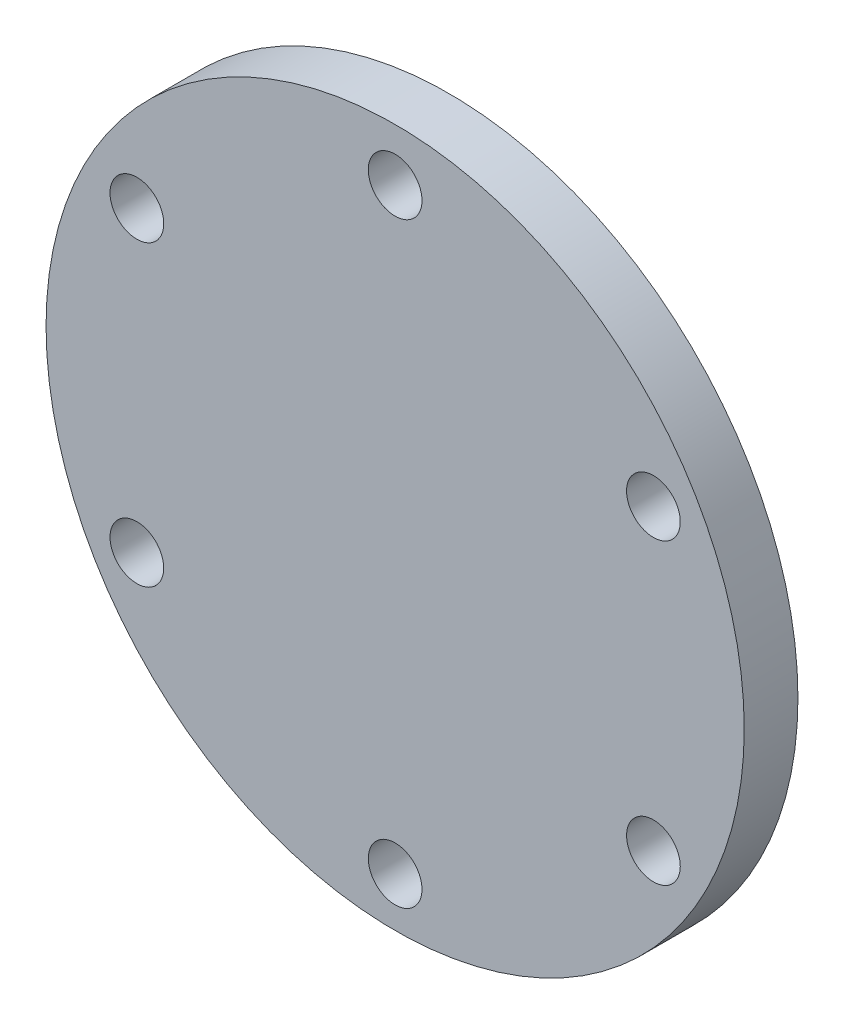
from build123d import *

# Parameters (mm, degrees)
SKETCH2_R           = 41.275
BOSS_EXTRUDE1_DEPTH = 6.35
SKETCH5_R           = 3.175
CUT_EXTRUDE3_DEPTH  = 59.716043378
CIRPATTERN2_COUNT   = 6


with BuildPart() as part:
    # Sketch2 → Boss-Extrude1 (new body)
    with BuildSketch(Plane.XY):
        Circle(SKETCH2_R)
    extrude(amount=BOSS_EXTRUDE1_DEPTH)

    # Sketch5 → Cut-Extrude3 (cut, through all)
    with BuildSketch(Plane.XY.offset(6.35)):
        with Locations((0, 35.052)):
            Circle(SKETCH5_R)
    cut_extrude3 = extrude(amount=-CUT_EXTRUDE3_DEPTH, mode=Mode.SUBTRACT)

    # CirPattern2: Cut-Extrude3 ×6 about axis
    cirpattern2_axis = Axis((0, -0.208642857, 0), (0, 0, 1))
    for i in range(1, CIRPATTERN2_COUNT):
        add(cut_extrude3.rotate(cirpattern2_axis, i * 360 / CIRPATTERN2_COUNT), mode=Mode.SUBTRACT)


solid = part.part
